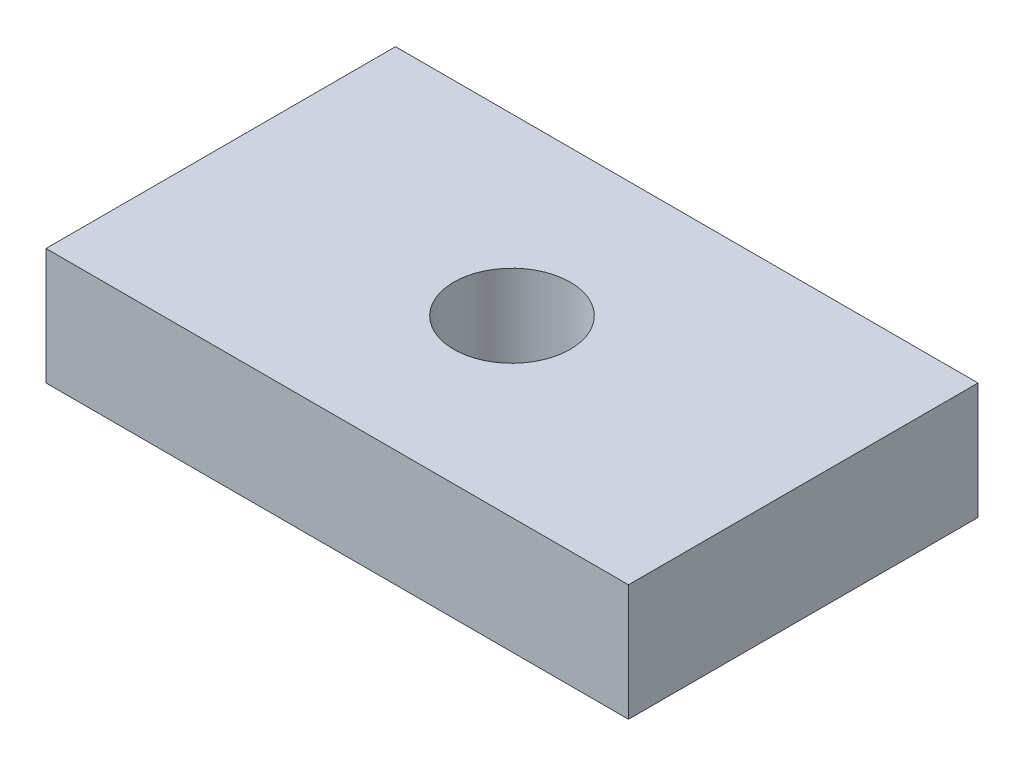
ISO-10303-21;
HEADER;
FILE_DESCRIPTION(('STEP AP214'),'2;1');
FILE_NAME('part.step','',(''),(''),'','','');
FILE_SCHEMA(('AUTOMOTIVE_DESIGN { 1 0 10303 214 1 1 1 1 }'));
ENDSEC;
DATA;
#1=APPLICATION_CONTEXT('core data for automotive mechanical design processes');
#2=APPLICATION_PROTOCOL_DEFINITION('international standard','automotive_design',2000,#1);
#3=PRODUCT_CONTEXT('',#1,'mechanical');
#4=PRODUCT('Part','Part','',(#3));
#5=PRODUCT_RELATED_PRODUCT_CATEGORY('part','',(#4));
#6=PRODUCT_DEFINITION_FORMATION('','',#4);
#7=PRODUCT_DEFINITION_CONTEXT('part definition',#1,'design');
#8=PRODUCT_DEFINITION('design','',#6,#7);
#9=PRODUCT_DEFINITION_SHAPE('','',#8);
#10=(LENGTH_UNIT() NAMED_UNIT(*) SI_UNIT(.MILLI.,.METRE.));
#11=(NAMED_UNIT(*) PLANE_ANGLE_UNIT() SI_UNIT($,.RADIAN.));
#12=(NAMED_UNIT(*) SI_UNIT($,.STERADIAN.) SOLID_ANGLE_UNIT());
#13=UNCERTAINTY_MEASURE_WITH_UNIT(LENGTH_MEASURE(1.E-05),#10,'distance_accuracy_value','');
#14=(GEOMETRIC_REPRESENTATION_CONTEXT(3) GLOBAL_UNCERTAINTY_ASSIGNED_CONTEXT((#13)) GLOBAL_UNIT_ASSIGNED_CONTEXT((#10,
#11,#12)) REPRESENTATION_CONTEXT('',''));
#15=CARTESIAN_POINT('',(0.,0.,0.));
#16=DIRECTION('',(0.,0.,1.));
#17=DIRECTION('',(1.,0.,0.));
#18=AXIS2_PLACEMENT_3D('',#15,#16,#17);
#19=CARTESIAN_POINT('',(50.,20.,30.));
#20=DIRECTION('',(-1.,0.,0.));
#21=DIRECTION('',(0.,0.,1.));
#22=AXIS2_PLACEMENT_3D('',#19,#20,#21);
#23=PLANE('',#22);
#24=DIRECTION('',(0.,0.,-1.));
#25=VECTOR('',#24,1.);
#26=CARTESIAN_POINT('',(50.,0.,30.));
#27=LINE('',#26,#25);
#28=CARTESIAN_POINT('',(50.,0.,30.));
#29=VERTEX_POINT('',#28);
#30=CARTESIAN_POINT('',(50.,0.,-30.));
#31=VERTEX_POINT('',#30);
#32=EDGE_CURVE('E102',#29,#31,#27,.T.);
#33=ORIENTED_EDGE('',*,*,#32,.T.);
#34=DIRECTION('',(0.,-1.,0.));
#35=VECTOR('',#34,1.);
#36=CARTESIAN_POINT('',(50.,20.,-30.));
#37=LINE('',#36,#35);
#38=CARTESIAN_POINT('',(50.,20.,-30.));
#39=VERTEX_POINT('',#38);
#40=EDGE_CURVE('E11',#39,#31,#37,.T.);
#41=ORIENTED_EDGE('',*,*,#40,.F.);
#42=DIRECTION('',(0.,0.,-1.));
#43=VECTOR('',#42,1.);
#44=CARTESIAN_POINT('',(50.,20.,30.));
#45=LINE('',#44,#43);
#46=CARTESIAN_POINT('',(50.,20.,30.));
#47=VERTEX_POINT('',#46);
#48=EDGE_CURVE('E95',#47,#39,#45,.T.);
#49=ORIENTED_EDGE('',*,*,#48,.F.);
#50=DIRECTION('',(0.,-1.,0.));
#51=VECTOR('',#50,1.);
#52=CARTESIAN_POINT('',(50.,20.,30.));
#53=LINE('',#52,#51);
#54=EDGE_CURVE('E99',#47,#29,#53,.T.);
#55=ORIENTED_EDGE('',*,*,#54,.T.);
#56=EDGE_LOOP('',(#33,#41,#49,#55));
#57=FACE_BOUND('',#56,.T.);
#58=ADVANCED_FACE('F41',(#57),#23,.F.);
#59=CARTESIAN_POINT('',(-50.,20.,-30.));
#60=DIRECTION('',(0.,0.,1.));
#61=DIRECTION('',(1.,0.,0.));
#62=AXIS2_PLACEMENT_3D('',#59,#60,#61);
#63=PLANE('',#62);
#64=DIRECTION('',(-1.,0.,0.));
#65=VECTOR('',#64,1.);
#66=CARTESIAN_POINT('',(-50.,0.,-30.));
#67=LINE('',#66,#65);
#68=CARTESIAN_POINT('',(-50.,0.,-30.));
#69=VERTEX_POINT('',#68);
#70=EDGE_CURVE('E96',#31,#69,#67,.T.);
#71=ORIENTED_EDGE('',*,*,#70,.T.);
#72=DIRECTION('',(0.,-1.,0.));
#73=VECTOR('',#72,1.);
#74=CARTESIAN_POINT('',(-50.,20.,-30.));
#75=LINE('',#74,#73);
#76=CARTESIAN_POINT('',(-50.,20.,-30.));
#77=VERTEX_POINT('',#76);
#78=EDGE_CURVE('E47',#77,#69,#75,.T.);
#79=ORIENTED_EDGE('',*,*,#78,.F.);
#80=DIRECTION('',(-1.,0.,0.));
#81=VECTOR('',#80,1.);
#82=CARTESIAN_POINT('',(-50.,20.,-30.));
#83=LINE('',#82,#81);
#84=EDGE_CURVE('E87',#39,#77,#83,.T.);
#85=ORIENTED_EDGE('',*,*,#84,.F.);
#86=ORIENTED_EDGE('',*,*,#40,.T.);
#87=EDGE_LOOP('',(#71,#79,#85,#86));
#88=FACE_BOUND('',#87,.T.);
#89=ADVANCED_FACE('F92',(#88),#63,.F.);
#90=CARTESIAN_POINT('',(-50.,20.,30.));
#91=DIRECTION('',(1.,0.,0.));
#92=DIRECTION('',(0.,0.,-1.));
#93=AXIS2_PLACEMENT_3D('',#90,#91,#92);
#94=PLANE('',#93);
#95=DIRECTION('',(0.,0.,1.));
#96=VECTOR('',#95,1.);
#97=CARTESIAN_POINT('',(-50.,0.,30.));
#98=LINE('',#97,#96);
#99=CARTESIAN_POINT('',(-50.,0.,30.));
#100=VERTEX_POINT('',#99);
#101=EDGE_CURVE('E74',#69,#100,#98,.T.);
#102=ORIENTED_EDGE('',*,*,#101,.T.);
#103=DIRECTION('',(0.,-1.,0.));
#104=VECTOR('',#103,1.);
#105=CARTESIAN_POINT('',(-50.,20.,30.));
#106=LINE('',#105,#104);
#107=CARTESIAN_POINT('',(-50.,20.,30.));
#108=VERTEX_POINT('',#107);
#109=EDGE_CURVE('E100',#108,#100,#106,.T.);
#110=ORIENTED_EDGE('',*,*,#109,.F.);
#111=DIRECTION('',(0.,0.,1.));
#112=VECTOR('',#111,1.);
#113=CARTESIAN_POINT('',(-50.,20.,30.));
#114=LINE('',#113,#112);
#115=EDGE_CURVE('E89',#77,#108,#114,.T.);
#116=ORIENTED_EDGE('',*,*,#115,.F.);
#117=ORIENTED_EDGE('',*,*,#78,.T.);
#118=EDGE_LOOP('',(#102,#110,#116,#117));
#119=FACE_BOUND('',#118,.T.);
#120=ADVANCED_FACE('F98',(#119),#94,.F.);
#121=CARTESIAN_POINT('',(-50.,20.,30.));
#122=DIRECTION('',(0.,0.,-1.));
#123=DIRECTION('',(-1.,0.,0.));
#124=AXIS2_PLACEMENT_3D('',#121,#122,#123);
#125=PLANE('',#124);
#126=DIRECTION('',(1.,0.,0.));
#127=VECTOR('',#126,1.);
#128=CARTESIAN_POINT('',(-50.,0.,30.));
#129=LINE('',#128,#127);
#130=EDGE_CURVE('E76',#100,#29,#129,.T.);
#131=ORIENTED_EDGE('',*,*,#130,.T.);
#132=ORIENTED_EDGE('',*,*,#54,.F.);
#133=DIRECTION('',(1.,0.,0.));
#134=VECTOR('',#133,1.);
#135=CARTESIAN_POINT('',(-50.,20.,30.));
#136=LINE('',#135,#134);
#137=EDGE_CURVE('E60',#108,#47,#136,.T.);
#138=ORIENTED_EDGE('',*,*,#137,.F.);
#139=ORIENTED_EDGE('',*,*,#109,.T.);
#140=EDGE_LOOP('',(#131,#132,#138,#139));
#141=FACE_BOUND('',#140,.T.);
#142=ADVANCED_FACE('F115',(#141),#125,.F.);
#143=CARTESIAN_POINT('',(0.,20.,0.));
#144=DIRECTION('',(0.,-1.,0.));
#145=DIRECTION('',(0.,0.,-1.));
#146=AXIS2_PLACEMENT_3D('',#143,#144,#145);
#147=PLANE('',#146);
#148=CARTESIAN_POINT('',(0.,20.,0.));
#149=DIRECTION('',(0.,-1.,0.));
#150=DIRECTION('',(0.,0.,-1.));
#151=AXIS2_PLACEMENT_3D('',#148,#149,#150);
#152=CIRCLE('',#151,10.);
#153=CARTESIAN_POINT('',(0.,20.,-10.));
#154=VERTEX_POINT('',#153);
#155=EDGE_CURVE('E110',#154,#154,#152,.F.);
#156=ORIENTED_EDGE('',*,*,#155,.F.);
#157=EDGE_LOOP('',(#156));
#158=FACE_BOUND('',#157,.T.);
#159=ORIENTED_EDGE('',*,*,#48,.T.);
#160=ORIENTED_EDGE('',*,*,#84,.T.);
#161=ORIENTED_EDGE('',*,*,#115,.T.);
#162=ORIENTED_EDGE('',*,*,#137,.T.);
#163=EDGE_LOOP('',(#159,#160,#161,#162));
#164=FACE_BOUND('',#163,.T.);
#165=ADVANCED_FACE('F86',(#158,#164),#147,.F.);
#166=CARTESIAN_POINT('',(0.,0.,0.));
#167=DIRECTION('',(0.,-1.,0.));
#168=DIRECTION('',(0.,0.,-1.));
#169=AXIS2_PLACEMENT_3D('',#166,#167,#168);
#170=PLANE('',#169);
#171=CARTESIAN_POINT('',(0.,0.,0.));
#172=DIRECTION('',(0.,1.,0.));
#173=DIRECTION('',(0.,0.,1.));
#174=AXIS2_PLACEMENT_3D('',#171,#172,#173);
#175=CIRCLE('',#174,10.);
#176=CARTESIAN_POINT('',(0.,0.,10.));
#177=VERTEX_POINT('',#176);
#178=EDGE_CURVE('E116',#177,#177,#175,.T.);
#179=ORIENTED_EDGE('',*,*,#178,.T.);
#180=EDGE_LOOP('',(#179));
#181=FACE_BOUND('',#180,.T.);
#182=ORIENTED_EDGE('',*,*,#32,.F.);
#183=ORIENTED_EDGE('',*,*,#130,.F.);
#184=ORIENTED_EDGE('',*,*,#101,.F.);
#185=ORIENTED_EDGE('',*,*,#70,.F.);
#186=EDGE_LOOP('',(#182,#183,#184,#185));
#187=FACE_BOUND('',#186,.T.);
#188=ADVANCED_FACE('F113',(#181,#187),#170,.T.);
#189=CARTESIAN_POINT('',(0.,25.,0.));
#190=DIRECTION('',(0.,-1.,0.));
#191=DIRECTION('',(0.,0.,-1.));
#192=AXIS2_PLACEMENT_3D('',#189,#190,#191);
#193=CYLINDRICAL_SURFACE('',#192,10.);
#194=ORIENTED_EDGE('',*,*,#178,.F.);
#195=EDGE_LOOP('',(#194));
#196=FACE_BOUND('',#195,.T.);
#197=ORIENTED_EDGE('',*,*,#155,.T.);
#198=EDGE_LOOP('',(#197));
#199=FACE_BOUND('',#198,.T.);
#200=ADVANCED_FACE('F125',(#196,#199),#193,.F.);
#201=CLOSED_SHELL('',(#58,#89,#120,#142,#165,#188,#200));
#202=MANIFOLD_SOLID_BREP('B2',#201);
#203=ADVANCED_BREP_SHAPE_REPRESENTATION('',(#18,#202),#14);
#204=SHAPE_DEFINITION_REPRESENTATION(#9,#203);
ENDSEC;
END-ISO-10303-21;
